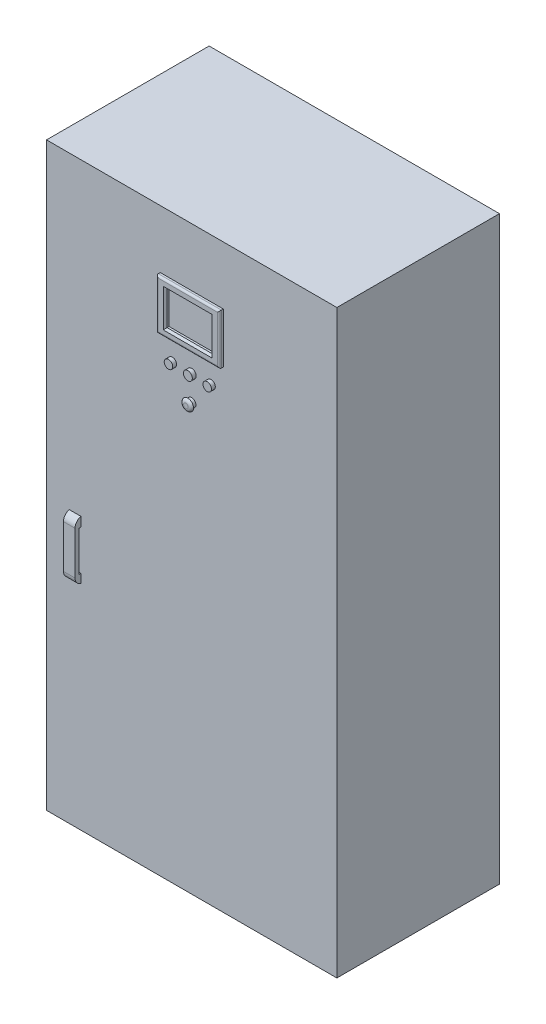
ISO-10303-21;
HEADER;
FILE_DESCRIPTION(('STEP AP214'),'2;1');
FILE_NAME('part.step','',(''),(''),'','','');
FILE_SCHEMA(('AUTOMOTIVE_DESIGN { 1 0 10303 214 1 1 1 1 }'));
ENDSEC;
DATA;
#1=APPLICATION_CONTEXT('core data for automotive mechanical design processes');
#2=APPLICATION_PROTOCOL_DEFINITION('international standard','automotive_design',2000,#1);
#3=PRODUCT_CONTEXT('',#1,'mechanical');
#4=PRODUCT('Part','Part','',(#3));
#5=PRODUCT_RELATED_PRODUCT_CATEGORY('part','',(#4));
#6=PRODUCT_DEFINITION_FORMATION('','',#4);
#7=PRODUCT_DEFINITION_CONTEXT('part definition',#1,'design');
#8=PRODUCT_DEFINITION('design','',#6,#7);
#9=PRODUCT_DEFINITION_SHAPE('','',#8);
#10=(LENGTH_UNIT() NAMED_UNIT(*) SI_UNIT(.MILLI.,.METRE.));
#11=(NAMED_UNIT(*) PLANE_ANGLE_UNIT() SI_UNIT($,.RADIAN.));
#12=(NAMED_UNIT(*) SI_UNIT($,.STERADIAN.) SOLID_ANGLE_UNIT());
#13=UNCERTAINTY_MEASURE_WITH_UNIT(LENGTH_MEASURE(1.E-05),#10,'distance_accuracy_value','');
#14=(GEOMETRIC_REPRESENTATION_CONTEXT(3) GLOBAL_UNCERTAINTY_ASSIGNED_CONTEXT((#13)) GLOBAL_UNIT_ASSIGNED_CONTEXT((#10,
#11,#12)) REPRESENTATION_CONTEXT('',''));
#15=CARTESIAN_POINT('',(0.,0.,0.));
#16=DIRECTION('',(0.,0.,1.));
#17=DIRECTION('',(1.,0.,0.));
#18=AXIS2_PLACEMENT_3D('',#15,#16,#17);
#19=CARTESIAN_POINT('',(0.,1500.,0.));
#20=DIRECTION('',(0.,0.,-1.));
#21=DIRECTION('',(-1.,0.,0.));
#22=AXIS2_PLACEMENT_3D('',#19,#20,#21);
#23=PLANE('',#22);
#24=DIRECTION('',(0.,-1.,0.));
#25=VECTOR('',#24,1.);
#26=CARTESIAN_POINT('',(58.6657650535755,702.214395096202,0.));
#27=LINE('',#26,#25);
#28=CARTESIAN_POINT('',(58.6657650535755,702.214395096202,0.));
#29=VERTEX_POINT('',#28);
#30=CARTESIAN_POINT('',(58.6657650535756,678.940627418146,0.));
#31=VERTEX_POINT('',#30);
#32=EDGE_CURVE('E330',#29,#31,#27,.T.);
#33=ORIENTED_EDGE('',*,*,#32,.F.);
#34=DIRECTION('',(-1.,0.,0.));
#35=VECTOR('',#34,1.);
#36=CARTESIAN_POINT('',(58.6657650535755,702.214395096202,0.));
#37=LINE('',#36,#35);
#38=CARTESIAN_POINT('',(88.6657650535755,702.214395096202,0.));
#39=VERTEX_POINT('',#38);
#40=EDGE_CURVE('E326',#39,#29,#37,.T.);
#41=ORIENTED_EDGE('',*,*,#40,.F.);
#42=DIRECTION('',(0.,1.,0.));
#43=VECTOR('',#42,1.);
#44=CARTESIAN_POINT('',(88.6657650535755,702.214395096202,0.));
#45=LINE('',#44,#43);
#46=CARTESIAN_POINT('',(88.6657650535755,677.99320694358,0.));
#47=VERTEX_POINT('',#46);
#48=EDGE_CURVE('E337',#47,#39,#45,.T.);
#49=ORIENTED_EDGE('',*,*,#48,.F.);
#50=DIRECTION('',(1.,0.,0.));
#51=VECTOR('',#50,1.);
#52=CARTESIAN_POINT('',(78.6657650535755,677.99320694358,0.));
#53=LINE('',#52,#51);
#54=CARTESIAN_POINT('',(78.6657650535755,677.99320694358,0.));
#55=VERTEX_POINT('',#54);
#56=EDGE_CURVE('E57',#55,#47,#53,.T.);
#57=ORIENTED_EDGE('',*,*,#56,.F.);
#58=DIRECTION('',(0.,1.,0.));
#59=VECTOR('',#58,1.);
#60=CARTESIAN_POINT('',(78.6657650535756,574.497572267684,0.));
#61=LINE('',#60,#59);
#62=CARTESIAN_POINT('',(78.6657650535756,574.497572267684,0.));
#63=VERTEX_POINT('',#62);
#64=EDGE_CURVE('E295',#63,#55,#61,.T.);
#65=ORIENTED_EDGE('',*,*,#64,.F.);
#66=DIRECTION('',(1.,0.,0.));
#67=VECTOR('',#66,1.);
#68=CARTESIAN_POINT('',(78.6657650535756,574.497572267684,0.));
#69=LINE('',#68,#67);
#70=CARTESIAN_POINT('',(88.6657650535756,574.497572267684,0.));
#71=VERTEX_POINT('',#70);
#72=EDGE_CURVE('E314',#63,#71,#69,.T.);
#73=ORIENTED_EDGE('',*,*,#72,.T.);
#74=CARTESIAN_POINT('',(88.6657650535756,552.214395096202,0.));
#75=VERTEX_POINT('',#74);
#76=EDGE_CURVE('E338',#75,#71,#45,.T.);
#77=ORIENTED_EDGE('',*,*,#76,.F.);
#78=DIRECTION('',(1.,0.,0.));
#79=VECTOR('',#78,1.);
#80=CARTESIAN_POINT('',(58.6657650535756,552.214395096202,0.));
#81=LINE('',#80,#79);
#82=CARTESIAN_POINT('',(58.6657650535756,552.214395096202,0.));
#83=VERTEX_POINT('',#82);
#84=EDGE_CURVE('E333',#83,#75,#81,.T.);
#85=ORIENTED_EDGE('',*,*,#84,.F.);
#86=CARTESIAN_POINT('',(58.6657650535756,573.902197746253,0.));
#87=VERTEX_POINT('',#86);
#88=EDGE_CURVE('E334',#87,#83,#27,.T.);
#89=ORIENTED_EDGE('',*,*,#88,.F.);
#90=DIRECTION('',(-1.,0.,0.));
#91=VECTOR('',#90,1.);
#92=CARTESIAN_POINT('',(68.6657650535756,573.902197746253,0.));
#93=LINE('',#92,#91);
#94=CARTESIAN_POINT('',(68.6657650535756,573.902197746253,0.));
#95=VERTEX_POINT('',#94);
#96=EDGE_CURVE('E49',#95,#87,#93,.T.);
#97=ORIENTED_EDGE('',*,*,#96,.F.);
#98=DIRECTION('',(0.,-1.,0.));
#99=VECTOR('',#98,1.);
#100=CARTESIAN_POINT('',(68.6657650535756,573.902197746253,0.));
#101=LINE('',#100,#99);
#102=CARTESIAN_POINT('',(68.6657650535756,678.940627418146,0.));
#103=VERTEX_POINT('',#102);
#104=EDGE_CURVE('E268',#103,#95,#101,.T.);
#105=ORIENTED_EDGE('',*,*,#104,.F.);
#106=DIRECTION('',(-1.,0.,0.));
#107=VECTOR('',#106,1.);
#108=CARTESIAN_POINT('',(68.6657650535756,678.940627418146,0.));
#109=LINE('',#108,#107);
#110=EDGE_CURVE('E287',#103,#31,#109,.T.);
#111=ORIENTED_EDGE('',*,*,#110,.T.);
#112=EDGE_LOOP('',(#33,#41,#49,#57,#65,#73,#77,#85,#89,#97,#105,#111));
#113=FACE_BOUND('',#112,.T.);
#114=CARTESIAN_POINT('',(425.,1165.48560768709,0.));
#115=DIRECTION('',(0.,0.,-1.));
#116=DIRECTION('',(-1.,0.,0.));
#117=AXIS2_PLACEMENT_3D('',#114,#115,#116);
#118=CIRCLE('',#117,11.);
#119=CARTESIAN_POINT('',(414.,1165.48560768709,0.));
#120=VERTEX_POINT('',#119);
#121=EDGE_CURVE('E429',#120,#120,#118,.F.);
#122=ORIENTED_EDGE('',*,*,#121,.F.);
#123=EDGE_LOOP('',(#122));
#124=FACE_BOUND('',#123,.T.);
#125=DIRECTION('',(0.,-1.,0.));
#126=VECTOR('',#125,1.);
#127=CARTESIAN_POINT('',(293.5,1350.,0.));
#128=LINE('',#127,#126);
#129=CARTESIAN_POINT('',(293.5,1350.,0.));
#130=VERTEX_POINT('',#129);
#131=CARTESIAN_POINT('',(293.5,1220.,0.));
#132=VERTEX_POINT('',#131);
#133=EDGE_CURVE('E376',#130,#132,#128,.T.);
#134=ORIENTED_EDGE('',*,*,#133,.F.);
#135=DIRECTION('',(-1.,0.,0.));
#136=VECTOR('',#135,1.);
#137=CARTESIAN_POINT('',(293.5,1350.,0.));
#138=LINE('',#137,#136);
#139=CARTESIAN_POINT('',(456.5,1350.,0.));
#140=VERTEX_POINT('',#139);
#141=EDGE_CURVE('E385',#140,#130,#138,.T.);
#142=ORIENTED_EDGE('',*,*,#141,.F.);
#143=DIRECTION('',(0.,1.,0.));
#144=VECTOR('',#143,1.);
#145=CARTESIAN_POINT('',(456.5,1350.,0.));
#146=LINE('',#145,#144);
#147=CARTESIAN_POINT('',(456.5,1220.,0.));
#148=VERTEX_POINT('',#147);
#149=EDGE_CURVE('E382',#148,#140,#146,.T.);
#150=ORIENTED_EDGE('',*,*,#149,.F.);
#151=DIRECTION('',(1.,0.,0.));
#152=VECTOR('',#151,1.);
#153=CARTESIAN_POINT('',(293.5,1220.,0.));
#154=LINE('',#153,#152);
#155=EDGE_CURVE('E379',#132,#148,#154,.T.);
#156=ORIENTED_EDGE('',*,*,#155,.F.);
#157=EDGE_LOOP('',(#134,#142,#150,#156));
#158=FACE_BOUND('',#157,.T.);
#159=DIRECTION('',(1.,0.,0.));
#160=VECTOR('',#159,1.);
#161=CARTESIAN_POINT('',(0.,0.,0.));
#162=LINE('',#161,#160);
#163=CARTESIAN_POINT('',(0.,0.,0.));
#164=VERTEX_POINT('',#163);
#165=CARTESIAN_POINT('',(750.,0.,0.));
#166=VERTEX_POINT('',#165);
#167=EDGE_CURVE('E410',#164,#166,#162,.T.);
#168=ORIENTED_EDGE('',*,*,#167,.T.);
#169=DIRECTION('',(0.,-1.,0.));
#170=VECTOR('',#169,1.);
#171=CARTESIAN_POINT('',(750.,1500.,0.));
#172=LINE('',#171,#170);
#173=CARTESIAN_POINT('',(750.,1500.,0.));
#174=VERTEX_POINT('',#173);
#175=EDGE_CURVE('E420',#174,#166,#172,.T.);
#176=ORIENTED_EDGE('',*,*,#175,.F.);
#177=DIRECTION('',(1.,0.,0.));
#178=VECTOR('',#177,1.);
#179=CARTESIAN_POINT('',(0.,1500.,0.));
#180=LINE('',#179,#178);
#181=CARTESIAN_POINT('',(0.,1500.,0.));
#182=VERTEX_POINT('',#181);
#183=EDGE_CURVE('E400',#182,#174,#180,.T.);
#184=ORIENTED_EDGE('',*,*,#183,.F.);
#185=DIRECTION('',(0.,-1.,0.));
#186=VECTOR('',#185,1.);
#187=CARTESIAN_POINT('',(0.,1500.,0.));
#188=LINE('',#187,#186);
#189=EDGE_CURVE('E423',#182,#164,#188,.T.);
#190=ORIENTED_EDGE('',*,*,#189,.T.);
#191=EDGE_LOOP('',(#168,#176,#184,#190));
#192=FACE_BOUND('',#191,.T.);
#193=CARTESIAN_POINT('',(325.,1165.48560768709,0.));
#194=DIRECTION('',(0.,0.,-1.));
#195=DIRECTION('',(-1.,0.,0.));
#196=AXIS2_PLACEMENT_3D('',#193,#194,#195);
#197=CIRCLE('',#196,11.);
#198=CARTESIAN_POINT('',(314.,1165.48560768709,0.));
#199=VERTEX_POINT('',#198);
#200=EDGE_CURVE('E426',#199,#199,#197,.F.);
#201=ORIENTED_EDGE('',*,*,#200,.F.);
#202=EDGE_LOOP('',(#201));
#203=FACE_BOUND('',#202,.T.);
#204=CARTESIAN_POINT('',(375.,1100.,0.));
#205=DIRECTION('',(0.,0.,-1.));
#206=DIRECTION('',(-1.,0.,0.));
#207=AXIS2_PLACEMENT_3D('',#204,#205,#206);
#208=CIRCLE('',#207,11.);
#209=CARTESIAN_POINT('',(364.,1100.,0.));
#210=VERTEX_POINT('',#209);
#211=EDGE_CURVE('E432',#210,#210,#208,.F.);
#212=ORIENTED_EDGE('',*,*,#211,.F.);
#213=EDGE_LOOP('',(#212));
#214=FACE_BOUND('',#213,.T.);
#215=CARTESIAN_POINT('',(375.,1164.89981854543,0.));
#216=DIRECTION('',(0.,0.,-1.));
#217=DIRECTION('',(-1.,0.,0.));
#218=AXIS2_PLACEMENT_3D('',#215,#216,#217);
#219=CIRCLE('',#218,11.4999999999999);
#220=CARTESIAN_POINT('',(363.5,1164.89981854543,0.));
#221=VERTEX_POINT('',#220);
#222=EDGE_CURVE('E11',#221,#221,#219,.F.);
#223=ORIENTED_EDGE('',*,*,#222,.F.);
#224=EDGE_LOOP('',(#223));
#225=FACE_BOUND('',#224,.T.);
#226=ADVANCED_FACE('F34',(#113,#124,#158,#192,#203,#214,#225),#23,.F.);
#227=CARTESIAN_POINT('',(0.,1500.,0.));
#228=DIRECTION('',(1.,0.,0.));
#229=DIRECTION('',(0.,0.,-1.));
#230=AXIS2_PLACEMENT_3D('',#227,#228,#229);
#231=PLANE('',#230);
#232=DIRECTION('',(0.,0.,1.));
#233=VECTOR('',#232,1.);
#234=CARTESIAN_POINT('',(0.,0.,0.));
#235=LINE('',#234,#233);
#236=CARTESIAN_POINT('',(0.,0.,-420.));
#237=VERTEX_POINT('',#236);
#238=EDGE_CURVE('E396',#237,#164,#235,.T.);
#239=ORIENTED_EDGE('',*,*,#238,.T.);
#240=ORIENTED_EDGE('',*,*,#189,.F.);
#241=DIRECTION('',(0.,0.,1.));
#242=VECTOR('',#241,1.);
#243=CARTESIAN_POINT('',(0.,1500.,0.));
#244=LINE('',#243,#242);
#245=CARTESIAN_POINT('',(0.,1500.,-420.));
#246=VERTEX_POINT('',#245);
#247=EDGE_CURVE('E397',#246,#182,#244,.T.);
#248=ORIENTED_EDGE('',*,*,#247,.F.);
#249=DIRECTION('',(0.,-1.,0.));
#250=VECTOR('',#249,1.);
#251=CARTESIAN_POINT('',(0.,1500.,-420.));
#252=LINE('',#251,#250);
#253=EDGE_CURVE('E407',#246,#237,#252,.T.);
#254=ORIENTED_EDGE('',*,*,#253,.T.);
#255=EDGE_LOOP('',(#239,#240,#248,#254));
#256=FACE_BOUND('',#255,.T.);
#257=ADVANCED_FACE('F545',(#256),#231,.F.);
#258=CARTESIAN_POINT('',(750.,1500.,0.));
#259=DIRECTION('',(-1.,0.,0.));
#260=DIRECTION('',(0.,0.,1.));
#261=AXIS2_PLACEMENT_3D('',#258,#259,#260);
#262=PLANE('',#261);
#263=DIRECTION('',(0.,0.,-1.));
#264=VECTOR('',#263,1.);
#265=CARTESIAN_POINT('',(750.,0.,0.));
#266=LINE('',#265,#264);
#267=CARTESIAN_POINT('',(750.,0.,-420.));
#268=VERTEX_POINT('',#267);
#269=EDGE_CURVE('E412',#166,#268,#266,.T.);
#270=ORIENTED_EDGE('',*,*,#269,.T.);
#271=DIRECTION('',(0.,-1.,0.));
#272=VECTOR('',#271,1.);
#273=CARTESIAN_POINT('',(750.,1500.,-420.));
#274=LINE('',#273,#272);
#275=CARTESIAN_POINT('',(750.,1500.,-420.));
#276=VERTEX_POINT('',#275);
#277=EDGE_CURVE('E417',#276,#268,#274,.T.);
#278=ORIENTED_EDGE('',*,*,#277,.F.);
#279=DIRECTION('',(0.,0.,-1.));
#280=VECTOR('',#279,1.);
#281=CARTESIAN_POINT('',(750.,1500.,0.));
#282=LINE('',#281,#280);
#283=EDGE_CURVE('E403',#174,#276,#282,.T.);
#284=ORIENTED_EDGE('',*,*,#283,.F.);
#285=ORIENTED_EDGE('',*,*,#175,.T.);
#286=EDGE_LOOP('',(#270,#278,#284,#285));
#287=FACE_BOUND('',#286,.T.);
#288=ADVANCED_FACE('F551',(#287),#262,.F.);
#289=CARTESIAN_POINT('',(0.,1500.,-420.));
#290=DIRECTION('',(0.,0.,1.));
#291=DIRECTION('',(1.,0.,0.));
#292=AXIS2_PLACEMENT_3D('',#289,#290,#291);
#293=PLANE('',#292);
#294=DIRECTION('',(-1.,0.,0.));
#295=VECTOR('',#294,1.);
#296=CARTESIAN_POINT('',(0.,0.,-420.));
#297=LINE('',#296,#295);
#298=EDGE_CURVE('E401',#268,#237,#297,.T.);
#299=ORIENTED_EDGE('',*,*,#298,.T.);
#300=ORIENTED_EDGE('',*,*,#253,.F.);
#301=DIRECTION('',(-1.,0.,0.));
#302=VECTOR('',#301,1.);
#303=CARTESIAN_POINT('',(0.,1500.,-420.));
#304=LINE('',#303,#302);
#305=EDGE_CURVE('E405',#276,#246,#304,.T.);
#306=ORIENTED_EDGE('',*,*,#305,.F.);
#307=ORIENTED_EDGE('',*,*,#277,.T.);
#308=EDGE_LOOP('',(#299,#300,#306,#307));
#309=FACE_BOUND('',#308,.T.);
#310=ADVANCED_FACE('F659',(#309),#293,.F.);
#311=CARTESIAN_POINT('',(0.,1500.,-420.));
#312=DIRECTION('',(0.,-1.,0.));
#313=DIRECTION('',(0.,0.,-1.));
#314=AXIS2_PLACEMENT_3D('',#311,#312,#313);
#315=PLANE('',#314);
#316=ORIENTED_EDGE('',*,*,#247,.T.);
#317=ORIENTED_EDGE('',*,*,#183,.T.);
#318=ORIENTED_EDGE('',*,*,#283,.T.);
#319=ORIENTED_EDGE('',*,*,#305,.T.);
#320=EDGE_LOOP('',(#316,#317,#318,#319));
#321=FACE_BOUND('',#320,.T.);
#322=ADVANCED_FACE('F656',(#321),#315,.F.);
#323=CARTESIAN_POINT('',(0.,0.,-420.));
#324=DIRECTION('',(0.,-1.,0.));
#325=DIRECTION('',(0.,0.,-1.));
#326=AXIS2_PLACEMENT_3D('',#323,#324,#325);
#327=PLANE('',#326);
#328=CARTESIAN_POINT('',(125.809545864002,0.,-389.004645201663));
#329=DIRECTION('',(0.,-1.,0.));
#330=DIRECTION('',(0.,0.,-1.));
#331=AXIS2_PLACEMENT_3D('',#328,#329,#330);
#332=CIRCLE('',#331,5.49999999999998);
#333=CARTESIAN_POINT('',(125.809545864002,0.,-394.504645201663));
#334=VERTEX_POINT('',#333);
#335=EDGE_CURVE('E242',#334,#334,#332,.T.);
#336=ORIENTED_EDGE('',*,*,#335,.F.);
#337=EDGE_LOOP('',(#336));
#338=FACE_BOUND('',#337,.T.);
#339=CARTESIAN_POINT('',(125.92891230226,0.,-45.4694269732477));
#340=DIRECTION('',(0.,-1.,0.));
#341=DIRECTION('',(0.,0.,-1.));
#342=AXIS2_PLACEMENT_3D('',#339,#340,#341);
#343=CIRCLE('',#342,5.49999999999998);
#344=CARTESIAN_POINT('',(125.92891230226,0.,-50.9694269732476));
#345=VERTEX_POINT('',#344);
#346=EDGE_CURVE('E241',#345,#345,#343,.T.);
#347=ORIENTED_EDGE('',*,*,#346,.F.);
#348=EDGE_LOOP('',(#347));
#349=FACE_BOUND('',#348,.T.);
#350=CARTESIAN_POINT('',(622.564613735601,0.,-44.0988043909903));
#351=DIRECTION('',(0.,-1.,0.));
#352=DIRECTION('',(0.,0.,-1.));
#353=AXIS2_PLACEMENT_3D('',#350,#351,#352);
#354=CIRCLE('',#353,5.49999999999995);
#355=CARTESIAN_POINT('',(622.564613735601,0.,-49.5988043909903));
#356=VERTEX_POINT('',#355);
#357=EDGE_CURVE('E252',#356,#356,#354,.T.);
#358=ORIENTED_EDGE('',*,*,#357,.F.);
#359=EDGE_LOOP('',(#358));
#360=FACE_BOUND('',#359,.T.);
#361=CARTESIAN_POINT('',(622.036868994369,0.,-389.496763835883));
#362=DIRECTION('',(0.,-1.,0.));
#363=DIRECTION('',(0.,0.,-1.));
#364=AXIS2_PLACEMENT_3D('',#361,#362,#363);
#365=CIRCLE('',#364,5.49999999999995);
#366=CARTESIAN_POINT('',(622.036868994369,0.,-394.996763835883));
#367=VERTEX_POINT('',#366);
#368=EDGE_CURVE('E258',#367,#367,#365,.T.);
#369=ORIENTED_EDGE('',*,*,#368,.F.);
#370=EDGE_LOOP('',(#369));
#371=FACE_BOUND('',#370,.T.);
#372=ORIENTED_EDGE('',*,*,#238,.F.);
#373=ORIENTED_EDGE('',*,*,#298,.F.);
#374=ORIENTED_EDGE('',*,*,#269,.F.);
#375=ORIENTED_EDGE('',*,*,#167,.F.);
#376=EDGE_LOOP('',(#372,#373,#374,#375));
#377=FACE_BOUND('',#376,.T.);
#378=ADVANCED_FACE('F607',(#338,#349,#360,#371,#377),#327,.T.);
#379=CARTESIAN_POINT('',(293.5,1220.,10.));
#380=DIRECTION('',(0.,0.,1.));
#381=DIRECTION('',(1.,0.,0.));
#382=AXIS2_PLACEMENT_3D('',#379,#380,#381);
#383=PLANE('',#382);
#384=DIRECTION('',(1.,0.,0.));
#385=VECTOR('',#384,1.);
#386=CARTESIAN_POINT('',(293.5,1333.28524782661,10.));
#387=LINE('',#386,#385);
#388=CARTESIAN_POINT('',(311.5,1333.28524782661,10.));
#389=VERTEX_POINT('',#388);
#390=CARTESIAN_POINT('',(437.022533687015,1333.28524782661,10.));
#391=VERTEX_POINT('',#390);
#392=EDGE_CURVE('E469',#389,#391,#387,.T.);
#393=ORIENTED_EDGE('',*,*,#392,.T.);
#394=DIRECTION('',(0.,-1.,0.));
#395=VECTOR('',#394,1.);
#396=CARTESIAN_POINT('',(437.022533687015,1220.,10.));
#397=LINE('',#396,#395);
#398=CARTESIAN_POINT('',(437.022533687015,1235.65223914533,10.));
#399=VERTEX_POINT('',#398);
#400=EDGE_CURVE('E473',#391,#399,#397,.T.);
#401=ORIENTED_EDGE('',*,*,#400,.T.);
#402=DIRECTION('',(-1.,0.,0.));
#403=VECTOR('',#402,1.);
#404=CARTESIAN_POINT('',(293.5,1235.65223914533,10.));
#405=LINE('',#404,#403);
#406=CARTESIAN_POINT('',(311.5,1235.65223914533,10.));
#407=VERTEX_POINT('',#406);
#408=EDGE_CURVE('E471',#399,#407,#405,.T.);
#409=ORIENTED_EDGE('',*,*,#408,.T.);
#410=DIRECTION('',(0.,1.,0.));
#411=VECTOR('',#410,1.);
#412=CARTESIAN_POINT('',(311.5,1220.,10.));
#413=LINE('',#412,#411);
#414=EDGE_CURVE('E467',#407,#389,#413,.T.);
#415=ORIENTED_EDGE('',*,*,#414,.T.);
#416=EDGE_LOOP('',(#393,#401,#409,#415));
#417=FACE_BOUND('',#416,.T.);
#418=DIRECTION('',(1.,0.,0.));
#419=VECTOR('',#418,1.);
#420=CARTESIAN_POINT('',(456.5,1225.,10.));
#421=LINE('',#420,#419);
#422=CARTESIAN_POINT('',(298.5,1225.,10.));
#423=VERTEX_POINT('',#422);
#424=CARTESIAN_POINT('',(451.5,1225.,10.));
#425=VERTEX_POINT('',#424);
#426=EDGE_CURVE('E442',#423,#425,#421,.T.);
#427=ORIENTED_EDGE('',*,*,#426,.T.);
#428=DIRECTION('',(0.,1.,0.));
#429=VECTOR('',#428,1.);
#430=CARTESIAN_POINT('',(451.5,1350.,10.));
#431=LINE('',#430,#429);
#432=CARTESIAN_POINT('',(451.5,1345.,10.));
#433=VERTEX_POINT('',#432);
#434=EDGE_CURVE('E444',#425,#433,#431,.T.);
#435=ORIENTED_EDGE('',*,*,#434,.T.);
#436=DIRECTION('',(-1.,0.,0.));
#437=VECTOR('',#436,1.);
#438=CARTESIAN_POINT('',(293.5,1345.,10.));
#439=LINE('',#438,#437);
#440=CARTESIAN_POINT('',(298.5,1345.,10.));
#441=VERTEX_POINT('',#440);
#442=EDGE_CURVE('E438',#433,#441,#439,.T.);
#443=ORIENTED_EDGE('',*,*,#442,.T.);
#444=DIRECTION('',(0.,-1.,0.));
#445=VECTOR('',#444,1.);
#446=CARTESIAN_POINT('',(298.5,1220.,10.));
#447=LINE('',#446,#445);
#448=EDGE_CURVE('E440',#441,#423,#447,.T.);
#449=ORIENTED_EDGE('',*,*,#448,.T.);
#450=EDGE_LOOP('',(#427,#435,#443,#449));
#451=FACE_BOUND('',#450,.T.);
#452=ADVANCED_FACE('F603',(#417,#451),#383,.T.);
#453=CARTESIAN_POINT('',(293.5,1350.,10.));
#454=DIRECTION('',(1.,0.,0.));
#455=DIRECTION('',(0.,0.,-1.));
#456=AXIS2_PLACEMENT_3D('',#453,#454,#455);
#457=PLANE('',#456);
#458=DIRECTION('',(0.,0.,-1.));
#459=VECTOR('',#458,1.);
#460=CARTESIAN_POINT('',(293.5,1220.,10.));
#461=LINE('',#460,#459);
#462=CARTESIAN_POINT('',(293.5,1220.,5.));
#463=VERTEX_POINT('',#462);
#464=EDGE_CURVE('E394',#463,#132,#461,.T.);
#465=ORIENTED_EDGE('',*,*,#464,.F.);
#466=DIRECTION('',(0.,-1.,0.));
#467=VECTOR('',#466,1.);
#468=CARTESIAN_POINT('',(293.5,1350.,5.));
#469=LINE('',#468,#467);
#470=CARTESIAN_POINT('',(293.5,1350.,5.));
#471=VERTEX_POINT('',#470);
#472=EDGE_CURVE('E452',#463,#471,#469,.F.);
#473=ORIENTED_EDGE('',*,*,#472,.T.);
#474=DIRECTION('',(0.,0.,-1.));
#475=VECTOR('',#474,1.);
#476=CARTESIAN_POINT('',(293.5,1350.,10.));
#477=LINE('',#476,#475);
#478=EDGE_CURVE('E388',#471,#130,#477,.T.);
#479=ORIENTED_EDGE('',*,*,#478,.T.);
#480=ORIENTED_EDGE('',*,*,#133,.T.);
#481=EDGE_LOOP('',(#465,#473,#479,#480));
#482=FACE_BOUND('',#481,.T.);
#483=ADVANCED_FACE('F606',(#482),#457,.F.);
#484=CARTESIAN_POINT('',(293.5,1220.,10.));
#485=DIRECTION('',(0.,1.,0.));
#486=DIRECTION('',(0.,0.,1.));
#487=AXIS2_PLACEMENT_3D('',#484,#485,#486);
#488=PLANE('',#487);
#489=DIRECTION('',(0.,0.,-1.));
#490=VECTOR('',#489,1.);
#491=CARTESIAN_POINT('',(456.5,1220.,10.));
#492=LINE('',#491,#490);
#493=CARTESIAN_POINT('',(456.5,1220.,5.));
#494=VERTEX_POINT('',#493);
#495=EDGE_CURVE('E392',#494,#148,#492,.T.);
#496=ORIENTED_EDGE('',*,*,#495,.F.);
#497=DIRECTION('',(1.,0.,0.));
#498=VECTOR('',#497,1.);
#499=CARTESIAN_POINT('',(293.5,1220.,5.));
#500=LINE('',#499,#498);
#501=EDGE_CURVE('E450',#494,#463,#500,.F.);
#502=ORIENTED_EDGE('',*,*,#501,.T.);
#503=ORIENTED_EDGE('',*,*,#464,.T.);
#504=ORIENTED_EDGE('',*,*,#155,.T.);
#505=EDGE_LOOP('',(#496,#502,#503,#504));
#506=FACE_BOUND('',#505,.T.);
#507=ADVANCED_FACE('F645',(#506),#488,.F.);
#508=CARTESIAN_POINT('',(456.5,1350.,10.));
#509=DIRECTION('',(-1.,0.,0.));
#510=DIRECTION('',(0.,0.,1.));
#511=AXIS2_PLACEMENT_3D('',#508,#509,#510);
#512=PLANE('',#511);
#513=DIRECTION('',(0.,0.,-1.));
#514=VECTOR('',#513,1.);
#515=CARTESIAN_POINT('',(456.5,1350.,10.));
#516=LINE('',#515,#514);
#517=CARTESIAN_POINT('',(456.5,1350.,5.));
#518=VERTEX_POINT('',#517);
#519=EDGE_CURVE('E390',#518,#140,#516,.T.);
#520=ORIENTED_EDGE('',*,*,#519,.F.);
#521=DIRECTION('',(0.,1.,0.));
#522=VECTOR('',#521,1.);
#523=CARTESIAN_POINT('',(456.5,1220.,5.));
#524=LINE('',#523,#522);
#525=EDGE_CURVE('E447',#518,#494,#524,.F.);
#526=ORIENTED_EDGE('',*,*,#525,.T.);
#527=ORIENTED_EDGE('',*,*,#495,.T.);
#528=ORIENTED_EDGE('',*,*,#149,.T.);
#529=EDGE_LOOP('',(#520,#526,#527,#528));
#530=FACE_BOUND('',#529,.T.);
#531=ADVANCED_FACE('F642',(#530),#512,.F.);
#532=CARTESIAN_POINT('',(293.5,1350.,10.));
#533=DIRECTION('',(0.,-1.,0.));
#534=DIRECTION('',(0.,0.,-1.));
#535=AXIS2_PLACEMENT_3D('',#532,#533,#534);
#536=PLANE('',#535);
#537=ORIENTED_EDGE('',*,*,#478,.F.);
#538=DIRECTION('',(-1.,0.,0.));
#539=VECTOR('',#538,1.);
#540=CARTESIAN_POINT('',(456.5,1350.,5.));
#541=LINE('',#540,#539);
#542=EDGE_CURVE('E454',#471,#518,#541,.F.);
#543=ORIENTED_EDGE('',*,*,#542,.T.);
#544=ORIENTED_EDGE('',*,*,#519,.T.);
#545=ORIENTED_EDGE('',*,*,#141,.T.);
#546=EDGE_LOOP('',(#537,#543,#544,#545));
#547=FACE_BOUND('',#546,.T.);
#548=ADVANCED_FACE('F634',(#547),#536,.F.);
#549=CARTESIAN_POINT('',(316.5,1240.65223914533,10.));
#550=DIRECTION('',(1.,0.,0.));
#551=DIRECTION('',(0.,0.,-1.));
#552=AXIS2_PLACEMENT_3D('',#549,#550,#551);
#553=PLANE('',#552);
#554=DIRECTION('',(0.,0.,-1.));
#555=VECTOR('',#554,1.);
#556=CARTESIAN_POINT('',(316.5,1328.28524782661,10.));
#557=LINE('',#556,#555);
#558=CARTESIAN_POINT('',(316.5,1328.28524782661,5.00000000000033));
#559=VERTEX_POINT('',#558);
#560=CARTESIAN_POINT('',(316.5,1328.28524782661,0.));
#561=VERTEX_POINT('',#560);
#562=EDGE_CURVE('E368',#559,#561,#557,.T.);
#563=ORIENTED_EDGE('',*,*,#562,.F.);
#564=DIRECTION('',(0.,-1.,0.));
#565=VECTOR('',#564,1.);
#566=CARTESIAN_POINT('',(316.5,1240.65223914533,5.00000000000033));
#567=LINE('',#566,#565);
#568=CARTESIAN_POINT('',(316.5,1240.65223914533,5.00000000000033));
#569=VERTEX_POINT('',#568);
#570=EDGE_CURVE('E480',#559,#569,#567,.T.);
#571=ORIENTED_EDGE('',*,*,#570,.T.);
#572=DIRECTION('',(0.,0.,-1.));
#573=VECTOR('',#572,1.);
#574=CARTESIAN_POINT('',(316.5,1240.65223914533,10.));
#575=LINE('',#574,#573);
#576=CARTESIAN_POINT('',(316.5,1240.65223914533,0.));
#577=VERTEX_POINT('',#576);
#578=EDGE_CURVE('E374',#569,#577,#575,.T.);
#579=ORIENTED_EDGE('',*,*,#578,.T.);
#580=DIRECTION('',(0.,-1.,0.));
#581=VECTOR('',#580,1.);
#582=CARTESIAN_POINT('',(316.5,1240.65223914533,0.));
#583=LINE('',#582,#581);
#584=EDGE_CURVE('E356',#561,#577,#583,.T.);
#585=ORIENTED_EDGE('',*,*,#584,.F.);
#586=EDGE_LOOP('',(#563,#571,#579,#585));
#587=FACE_BOUND('',#586,.T.);
#588=ADVANCED_FACE('F577',(#587),#553,.T.);
#589=CARTESIAN_POINT('',(316.5,1240.65223914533,10.));
#590=DIRECTION('',(0.,1.,0.));
#591=DIRECTION('',(0.,0.,1.));
#592=AXIS2_PLACEMENT_3D('',#589,#590,#591);
#593=PLANE('',#592);
#594=ORIENTED_EDGE('',*,*,#578,.F.);
#595=DIRECTION('',(1.,0.,0.));
#596=VECTOR('',#595,1.);
#597=CARTESIAN_POINT('',(316.5,1240.65223914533,5.00000000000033));
#598=LINE('',#597,#596);
#599=CARTESIAN_POINT('',(432.022533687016,1240.65223914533,5.00000000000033));
#600=VERTEX_POINT('',#599);
#601=EDGE_CURVE('E476',#569,#600,#598,.T.);
#602=ORIENTED_EDGE('',*,*,#601,.T.);
#603=DIRECTION('',(0.,0.,-1.));
#604=VECTOR('',#603,1.);
#605=CARTESIAN_POINT('',(432.022533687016,1240.65223914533,10.));
#606=LINE('',#605,#604);
#607=CARTESIAN_POINT('',(432.022533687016,1240.65223914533,0.));
#608=VERTEX_POINT('',#607);
#609=EDGE_CURVE('E372',#600,#608,#606,.T.);
#610=ORIENTED_EDGE('',*,*,#609,.T.);
#611=DIRECTION('',(1.,0.,0.));
#612=VECTOR('',#611,1.);
#613=CARTESIAN_POINT('',(316.5,1240.65223914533,0.));
#614=LINE('',#613,#612);
#615=EDGE_CURVE('E359',#577,#608,#614,.T.);
#616=ORIENTED_EDGE('',*,*,#615,.F.);
#617=EDGE_LOOP('',(#594,#602,#610,#616));
#618=FACE_BOUND('',#617,.T.);
#619=ADVANCED_FACE('F582',(#618),#593,.T.);
#620=CARTESIAN_POINT('',(432.022533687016,1240.65223914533,10.));
#621=DIRECTION('',(-1.,0.,0.));
#622=DIRECTION('',(0.,0.,1.));
#623=AXIS2_PLACEMENT_3D('',#620,#621,#622);
#624=PLANE('',#623);
#625=ORIENTED_EDGE('',*,*,#609,.F.);
#626=DIRECTION('',(0.,1.,0.));
#627=VECTOR('',#626,1.);
#628=CARTESIAN_POINT('',(432.022533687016,1240.65223914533,5.00000000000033));
#629=LINE('',#628,#627);
#630=CARTESIAN_POINT('',(432.022533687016,1328.28524782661,5.00000000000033));
#631=VERTEX_POINT('',#630);
#632=EDGE_CURVE('E456',#600,#631,#629,.T.);
#633=ORIENTED_EDGE('',*,*,#632,.T.);
#634=DIRECTION('',(0.,0.,-1.));
#635=VECTOR('',#634,1.);
#636=CARTESIAN_POINT('',(432.022533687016,1328.28524782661,10.));
#637=LINE('',#636,#635);
#638=CARTESIAN_POINT('',(432.022533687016,1328.28524782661,0.));
#639=VERTEX_POINT('',#638);
#640=EDGE_CURVE('E370',#631,#639,#637,.T.);
#641=ORIENTED_EDGE('',*,*,#640,.T.);
#642=DIRECTION('',(0.,1.,0.));
#643=VECTOR('',#642,1.);
#644=CARTESIAN_POINT('',(432.022533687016,1240.65223914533,0.));
#645=LINE('',#644,#643);
#646=EDGE_CURVE('E362',#608,#639,#645,.T.);
#647=ORIENTED_EDGE('',*,*,#646,.F.);
#648=EDGE_LOOP('',(#625,#633,#641,#647));
#649=FACE_BOUND('',#648,.T.);
#650=ADVANCED_FACE('F566',(#649),#624,.T.);
#651=CARTESIAN_POINT('',(316.5,1328.28524782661,10.));
#652=DIRECTION('',(0.,-1.,0.));
#653=DIRECTION('',(0.,0.,-1.));
#654=AXIS2_PLACEMENT_3D('',#651,#652,#653);
#655=PLANE('',#654);
#656=ORIENTED_EDGE('',*,*,#640,.F.);
#657=DIRECTION('',(-1.,0.,0.));
#658=VECTOR('',#657,1.);
#659=CARTESIAN_POINT('',(316.5,1328.28524782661,5.00000000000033));
#660=LINE('',#659,#658);
#661=EDGE_CURVE('E478',#631,#559,#660,.T.);
#662=ORIENTED_EDGE('',*,*,#661,.T.);
#663=ORIENTED_EDGE('',*,*,#562,.T.);
#664=DIRECTION('',(-1.,0.,0.));
#665=VECTOR('',#664,1.);
#666=CARTESIAN_POINT('',(316.5,1328.28524782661,0.));
#667=LINE('',#666,#665);
#668=EDGE_CURVE('E365',#639,#561,#667,.T.);
#669=ORIENTED_EDGE('',*,*,#668,.F.);
#670=EDGE_LOOP('',(#656,#662,#663,#669));
#671=FACE_BOUND('',#670,.T.);
#672=ADVANCED_FACE('F557',(#671),#655,.T.);
#673=ORIENTED_EDGE('',*,*,#668,.T.);
#674=ORIENTED_EDGE('',*,*,#584,.T.);
#675=ORIENTED_EDGE('',*,*,#615,.T.);
#676=ORIENTED_EDGE('',*,*,#646,.T.);
#677=EDGE_LOOP('',(#673,#674,#675,#676));
#678=FACE_BOUND('',#677,.T.);
#679=ADVANCED_FACE('F547',(#678),#23,.F.);
#680=CARTESIAN_POINT('',(325.,1165.48560768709,10.));
#681=DIRECTION('',(0.,0.,-1.));
#682=DIRECTION('',(-1.,0.,0.));
#683=AXIS2_PLACEMENT_3D('',#680,#681,#682);
#684=CYLINDRICAL_SURFACE('',#683,11.);
#685=CARTESIAN_POINT('',(325.,1165.48560768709,10.));
#686=DIRECTION('',(0.,0.,1.));
#687=DIRECTION('',(1.,0.,0.));
#688=AXIS2_PLACEMENT_3D('',#685,#686,#687);
#689=CIRCLE('',#688,11.);
#690=CARTESIAN_POINT('',(336.,1165.48560768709,10.));
#691=VERTEX_POINT('',#690);
#692=EDGE_CURVE('E353',#691,#691,#689,.T.);
#693=ORIENTED_EDGE('',*,*,#692,.F.);
#694=EDGE_LOOP('',(#693));
#695=FACE_BOUND('',#694,.T.);
#696=ORIENTED_EDGE('',*,*,#200,.T.);
#697=EDGE_LOOP('',(#696));
#698=FACE_BOUND('',#697,.T.);
#699=ADVANCED_FACE('F556',(#695,#698),#684,.T.);
#700=CARTESIAN_POINT('',(325.,1165.48560768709,10.));
#701=DIRECTION('',(0.,0.,1.));
#702=DIRECTION('',(1.,0.,0.));
#703=AXIS2_PLACEMENT_3D('',#700,#701,#702);
#704=PLANE('',#703);
#705=ORIENTED_EDGE('',*,*,#692,.T.);
#706=EDGE_LOOP('',(#705));
#707=FACE_BOUND('',#706,.T.);
#708=ADVANCED_FACE('F563',(#707),#704,.T.);
#709=CARTESIAN_POINT('',(425.,1165.48560768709,10.));
#710=DIRECTION('',(0.,0.,-1.));
#711=DIRECTION('',(-1.,0.,0.));
#712=AXIS2_PLACEMENT_3D('',#709,#710,#711);
#713=CYLINDRICAL_SURFACE('',#712,11.);
#714=CARTESIAN_POINT('',(425.,1165.48560768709,10.));
#715=DIRECTION('',(0.,0.,1.));
#716=DIRECTION('',(1.,0.,0.));
#717=AXIS2_PLACEMENT_3D('',#714,#715,#716);
#718=CIRCLE('',#717,11.);
#719=CARTESIAN_POINT('',(436.,1165.48560768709,10.));
#720=VERTEX_POINT('',#719);
#721=EDGE_CURVE('E350',#720,#720,#718,.T.);
#722=ORIENTED_EDGE('',*,*,#721,.F.);
#723=EDGE_LOOP('',(#722));
#724=FACE_BOUND('',#723,.T.);
#725=ORIENTED_EDGE('',*,*,#121,.T.);
#726=EDGE_LOOP('',(#725));
#727=FACE_BOUND('',#726,.T.);
#728=ADVANCED_FACE('F777',(#724,#727),#713,.T.);
#729=CARTESIAN_POINT('',(425.,1165.48560768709,10.));
#730=DIRECTION('',(0.,0.,1.));
#731=DIRECTION('',(1.,0.,0.));
#732=AXIS2_PLACEMENT_3D('',#729,#730,#731);
#733=PLANE('',#732);
#734=ORIENTED_EDGE('',*,*,#721,.T.);
#735=EDGE_LOOP('',(#734));
#736=FACE_BOUND('',#735,.T.);
#737=ADVANCED_FACE('F772',(#736),#733,.T.);
#738=CARTESIAN_POINT('',(375.,1100.,10.));
#739=DIRECTION('',(0.,0.,-1.));
#740=DIRECTION('',(-1.,0.,0.));
#741=AXIS2_PLACEMENT_3D('',#738,#739,#740);
#742=CYLINDRICAL_SURFACE('',#741,11.);
#743=CARTESIAN_POINT('',(375.,1100.,10.));
#744=DIRECTION('',(0.,0.,1.));
#745=DIRECTION('',(1.,0.,0.));
#746=AXIS2_PLACEMENT_3D('',#743,#744,#745);
#747=CIRCLE('',#746,11.);
#748=CARTESIAN_POINT('',(386.,1100.,10.));
#749=VERTEX_POINT('',#748);
#750=EDGE_CURVE('E346',#749,#749,#747,.T.);
#751=ORIENTED_EDGE('',*,*,#750,.F.);
#752=EDGE_LOOP('',(#751));
#753=FACE_BOUND('',#752,.T.);
#754=ORIENTED_EDGE('',*,*,#211,.T.);
#755=EDGE_LOOP('',(#754));
#756=FACE_BOUND('',#755,.T.);
#757=ADVANCED_FACE('F766',(#753,#756),#742,.T.);
#758=CARTESIAN_POINT('',(375.,1100.,10.));
#759=DIRECTION('',(0.,0.,1.));
#760=DIRECTION('',(1.,0.,0.));
#761=AXIS2_PLACEMENT_3D('',#758,#759,#760);
#762=PLANE('',#761);
#763=CARTESIAN_POINT('',(375.,1100.,10.));
#764=DIRECTION('',(0.,0.,1.));
#765=DIRECTION('',(1.,0.,0.));
#766=AXIS2_PLACEMENT_3D('',#763,#764,#765);
#767=CIRCLE('',#766,14.7066830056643);
#768=CARTESIAN_POINT('',(389.706683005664,1100.,10.));
#769=VERTEX_POINT('',#768);
#770=EDGE_CURVE('E343',#769,#769,#767,.T.);
#771=ORIENTED_EDGE('',*,*,#770,.F.);
#772=EDGE_LOOP('',(#771));
#773=FACE_BOUND('',#772,.T.);
#774=ORIENTED_EDGE('',*,*,#750,.T.);
#775=EDGE_LOOP('',(#774));
#776=FACE_BOUND('',#775,.T.);
#777=ADVANCED_FACE('F757',(#773,#776),#762,.F.);
#778=CARTESIAN_POINT('',(375.,1100.,15.));
#779=DIRECTION('',(0.,0.,1.));
#780=DIRECTION('',(1.,0.,0.));
#781=AXIS2_PLACEMENT_3D('',#778,#779,#780);
#782=PLANE('',#781);
#783=CARTESIAN_POINT('',(375.,1100.,15.));
#784=DIRECTION('',(0.,0.,1.));
#785=DIRECTION('',(1.,0.,0.));
#786=AXIS2_PLACEMENT_3D('',#783,#784,#785);
#787=CIRCLE('',#786,6.04642896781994);
#788=CARTESIAN_POINT('',(381.04642896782,1100.,15.));
#789=VERTEX_POINT('',#788);
#790=EDGE_CURVE('E435',#789,#789,#787,.T.);
#791=ORIENTED_EDGE('',*,*,#790,.T.);
#792=EDGE_LOOP('',(#791));
#793=FACE_BOUND('',#792,.T.);
#794=ADVANCED_FACE('F752',(#793),#782,.T.);
#795=CARTESIAN_POINT('',(375.,1100.,5.));
#796=DIRECTION('',(0.,0.,-1.));
#797=DIRECTION('',(-1.,0.,0.));
#798=AXIS2_PLACEMENT_3D('',#795,#796,#797);
#799=DEGENERATE_TOROIDAL_SURFACE('',#798,6.04642896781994,10.,.T.);
#800=ORIENTED_EDGE('',*,*,#770,.T.);
#801=EDGE_LOOP('',(#800));
#802=FACE_BOUND('',#801,.T.);
#803=ORIENTED_EDGE('',*,*,#790,.F.);
#804=EDGE_LOOP('',(#803));
#805=FACE_BOUND('',#804,.T.);
#806=ADVANCED_FACE('F744',(#802,#805),#799,.T.);
#807=CARTESIAN_POINT('',(298.5,1220.,5.));
#808=DIRECTION('',(0.,1.,0.));
#809=DIRECTION('',(0.,0.,1.));
#810=AXIS2_PLACEMENT_3D('',#807,#808,#809);
#811=CYLINDRICAL_SURFACE('',#810,5.);
#812=CARTESIAN_POINT('',(298.5,1345.,5.));
#813=DIRECTION('',(0.707106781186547,0.707106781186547,0.));
#814=DIRECTION('',(0.707106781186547,-0.707106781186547,0.));
#815=AXIS2_PLACEMENT_3D('',#812,#813,#814);
#816=ELLIPSE('',#815,7.07106781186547,5.);
#817=EDGE_CURVE('E460',#471,#441,#816,.T.);
#818=ORIENTED_EDGE('',*,*,#817,.F.);
#819=ORIENTED_EDGE('',*,*,#472,.F.);
#820=CARTESIAN_POINT('',(298.5,1225.,5.));
#821=DIRECTION('',(-0.707106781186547,0.707106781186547,0.));
#822=DIRECTION('',(0.707106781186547,0.707106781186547,0.));
#823=AXIS2_PLACEMENT_3D('',#820,#821,#822);
#824=ELLIPSE('',#823,7.07106781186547,5.);
#825=EDGE_CURVE('E347',#423,#463,#824,.F.);
#826=ORIENTED_EDGE('',*,*,#825,.F.);
#827=ORIENTED_EDGE('',*,*,#448,.F.);
#828=EDGE_LOOP('',(#818,#819,#826,#827));
#829=FACE_BOUND('',#828,.T.);
#830=ADVANCED_FACE('F627',(#829),#811,.T.);
#831=CARTESIAN_POINT('',(293.5,1225.,5.));
#832=DIRECTION('',(-1.,0.,0.));
#833=DIRECTION('',(0.,0.,1.));
#834=AXIS2_PLACEMENT_3D('',#831,#832,#833);
#835=CYLINDRICAL_SURFACE('',#834,5.);
#836=ORIENTED_EDGE('',*,*,#825,.T.);
#837=ORIENTED_EDGE('',*,*,#501,.F.);
#838=CARTESIAN_POINT('',(451.5,1225.,5.));
#839=DIRECTION('',(-0.707106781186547,-0.707106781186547,0.));
#840=DIRECTION('',(-0.707106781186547,0.707106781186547,0.));
#841=AXIS2_PLACEMENT_3D('',#838,#839,#840);
#842=ELLIPSE('',#841,7.07106781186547,5.);
#843=EDGE_CURVE('E458',#425,#494,#842,.F.);
#844=ORIENTED_EDGE('',*,*,#843,.F.);
#845=ORIENTED_EDGE('',*,*,#426,.F.);
#846=EDGE_LOOP('',(#836,#837,#844,#845));
#847=FACE_BOUND('',#846,.T.);
#848=ADVANCED_FACE('F616',(#847),#835,.T.);
#849=CARTESIAN_POINT('',(293.5,1345.,5.));
#850=DIRECTION('',(1.,0.,0.));
#851=DIRECTION('',(0.,0.,-1.));
#852=AXIS2_PLACEMENT_3D('',#849,#850,#851);
#853=CYLINDRICAL_SURFACE('',#852,5.);
#854=ORIENTED_EDGE('',*,*,#817,.T.);
#855=ORIENTED_EDGE('',*,*,#442,.F.);
#856=CARTESIAN_POINT('',(451.5,1345.,5.));
#857=DIRECTION('',(0.707106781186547,-0.707106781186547,0.));
#858=DIRECTION('',(0.707106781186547,0.707106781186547,0.));
#859=AXIS2_PLACEMENT_3D('',#856,#857,#858);
#860=ELLIPSE('',#859,7.07106781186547,5.);
#861=EDGE_CURVE('E329',#518,#433,#860,.T.);
#862=ORIENTED_EDGE('',*,*,#861,.F.);
#863=ORIENTED_EDGE('',*,*,#542,.F.);
#864=EDGE_LOOP('',(#854,#855,#862,#863));
#865=FACE_BOUND('',#864,.T.);
#866=ADVANCED_FACE('F624',(#865),#853,.T.);
#867=CARTESIAN_POINT('',(451.5,1220.,5.));
#868=DIRECTION('',(0.,-1.,0.));
#869=DIRECTION('',(0.,0.,-1.));
#870=AXIS2_PLACEMENT_3D('',#867,#868,#869);
#871=CYLINDRICAL_SURFACE('',#870,5.);
#872=ORIENTED_EDGE('',*,*,#843,.T.);
#873=ORIENTED_EDGE('',*,*,#525,.F.);
#874=ORIENTED_EDGE('',*,*,#861,.T.);
#875=ORIENTED_EDGE('',*,*,#434,.F.);
#876=EDGE_LOOP('',(#872,#873,#874,#875));
#877=FACE_BOUND('',#876,.T.);
#878=ADVANCED_FACE('F619',(#877),#871,.T.);
#879=CARTESIAN_POINT('',(58.6657650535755,702.214395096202,15.));
#880=DIRECTION('',(1.,0.,0.));
#881=DIRECTION('',(0.,1.,0.));
#882=AXIS2_PLACEMENT_3D('',#879,#880,#881);
#883=PLANE('',#882);
#884=ORIENTED_EDGE('',*,*,#32,.T.);
#885=DIRECTION('',(0.,0.,-1.));
#886=VECTOR('',#885,1.);
#887=CARTESIAN_POINT('',(58.6657650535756,678.940627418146,0.));
#888=LINE('',#887,#886);
#889=CARTESIAN_POINT('',(58.6657650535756,678.940627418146,4.62796842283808));
#890=VERTEX_POINT('',#889);
#891=EDGE_CURVE('E272',#890,#31,#888,.T.);
#892=ORIENTED_EDGE('',*,*,#891,.F.);
#893=DIRECTION('',(0.,1.,0.));
#894=VECTOR('',#893,1.);
#895=CARTESIAN_POINT('',(58.6657650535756,573.902197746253,4.62796842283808));
#896=LINE('',#895,#894);
#897=CARTESIAN_POINT('',(58.6657650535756,573.902197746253,4.62796842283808));
#898=VERTEX_POINT('',#897);
#899=EDGE_CURVE('E282',#898,#890,#896,.T.);
#900=ORIENTED_EDGE('',*,*,#899,.F.);
#901=DIRECTION('',(0.,0.,1.));
#902=VECTOR('',#901,1.);
#903=CARTESIAN_POINT('',(58.6657650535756,573.902197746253,0.));
#904=LINE('',#903,#902);
#905=EDGE_CURVE('E267',#87,#898,#904,.T.);
#906=ORIENTED_EDGE('',*,*,#905,.F.);
#907=ORIENTED_EDGE('',*,*,#88,.T.);
#908=CARTESIAN_POINT('',(58.6657650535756,571.579311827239,-5.));
#909=DIRECTION('',(1.,0.,0.));
#910=DIRECTION('',(0.,1.,0.));
#911=AXIS2_PLACEMENT_3D('',#908,#909,#910);
#912=CIRCLE('',#911,20.);
#913=CARTESIAN_POINT('',(58.6657650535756,571.579311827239,15.));
#914=VERTEX_POINT('',#913);
#915=EDGE_CURVE('E42',#83,#914,#912,.F.);
#916=ORIENTED_EDGE('',*,*,#915,.T.);
#917=DIRECTION('',(0.,-1.,0.));
#918=VECTOR('',#917,1.);
#919=CARTESIAN_POINT('',(58.6657650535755,702.214395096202,15.));
#920=LINE('',#919,#918);
#921=CARTESIAN_POINT('',(58.6657650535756,682.849478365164,15.));
#922=VERTEX_POINT('',#921);
#923=EDGE_CURVE('E322',#922,#914,#920,.T.);
#924=ORIENTED_EDGE('',*,*,#923,.F.);
#925=CARTESIAN_POINT('',(58.6657650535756,682.849478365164,-5.));
#926=DIRECTION('',(1.,0.,0.));
#927=DIRECTION('',(0.,1.,0.));
#928=AXIS2_PLACEMENT_3D('',#925,#926,#927);
#929=CIRCLE('',#928,20.);
#930=EDGE_CURVE('E501',#922,#29,#929,.F.);
#931=ORIENTED_EDGE('',*,*,#930,.T.);
#932=EDGE_LOOP('',(#884,#892,#900,#906,#907,#916,#924,#931));
#933=FACE_BOUND('',#932,.T.);
#934=ADVANCED_FACE('F505',(#933),#883,.F.);
#935=CARTESIAN_POINT('',(88.6657650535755,702.214395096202,15.));
#936=DIRECTION('',(-1.,0.,0.));
#937=DIRECTION('',(0.,-1.,0.));
#938=AXIS2_PLACEMENT_3D('',#935,#936,#937);
#939=PLANE('',#938);
#940=ORIENTED_EDGE('',*,*,#76,.T.);
#941=DIRECTION('',(0.,0.,-1.));
#942=VECTOR('',#941,1.);
#943=CARTESIAN_POINT('',(88.6657650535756,574.497572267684,0.));
#944=LINE('',#943,#942);
#945=CARTESIAN_POINT('',(88.6657650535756,574.497572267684,4.81276113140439));
#946=VERTEX_POINT('',#945);
#947=EDGE_CURVE('E299',#946,#71,#944,.T.);
#948=ORIENTED_EDGE('',*,*,#947,.F.);
#949=DIRECTION('',(0.,-1.,0.));
#950=VECTOR('',#949,1.);
#951=CARTESIAN_POINT('',(88.6657650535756,574.497572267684,4.81276113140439));
#952=LINE('',#951,#950);
#953=CARTESIAN_POINT('',(88.6657650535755,677.99320694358,4.81276113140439));
#954=VERTEX_POINT('',#953);
#955=EDGE_CURVE('E309',#954,#946,#952,.T.);
#956=ORIENTED_EDGE('',*,*,#955,.F.);
#957=DIRECTION('',(0.,0.,1.));
#958=VECTOR('',#957,1.);
#959=CARTESIAN_POINT('',(88.6657650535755,677.99320694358,0.));
#960=LINE('',#959,#958);
#961=EDGE_CURVE('E289',#47,#954,#960,.T.);
#962=ORIENTED_EDGE('',*,*,#961,.F.);
#963=ORIENTED_EDGE('',*,*,#48,.T.);
#964=CARTESIAN_POINT('',(88.6657650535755,682.849478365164,-5.));
#965=DIRECTION('',(-1.,0.,0.));
#966=DIRECTION('',(0.,-1.,0.));
#967=AXIS2_PLACEMENT_3D('',#964,#965,#966);
#968=CIRCLE('',#967,20.);
#969=CARTESIAN_POINT('',(88.6657650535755,682.849478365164,15.));
#970=VERTEX_POINT('',#969);
#971=EDGE_CURVE('E497',#39,#970,#968,.F.);
#972=ORIENTED_EDGE('',*,*,#971,.T.);
#973=DIRECTION('',(0.,1.,0.));
#974=VECTOR('',#973,1.);
#975=CARTESIAN_POINT('',(88.6657650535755,702.214395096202,15.));
#976=LINE('',#975,#974);
#977=CARTESIAN_POINT('',(88.6657650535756,571.579311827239,15.));
#978=VERTEX_POINT('',#977);
#979=EDGE_CURVE('E325',#978,#970,#976,.T.);
#980=ORIENTED_EDGE('',*,*,#979,.F.);
#981=CARTESIAN_POINT('',(88.6657650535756,571.579311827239,-5.));
#982=DIRECTION('',(-1.,0.,0.));
#983=DIRECTION('',(0.,-1.,0.));
#984=AXIS2_PLACEMENT_3D('',#981,#982,#983);
#985=CIRCLE('',#984,20.);
#986=EDGE_CURVE('E499',#978,#75,#985,.F.);
#987=ORIENTED_EDGE('',*,*,#986,.T.);
#988=EDGE_LOOP('',(#940,#948,#956,#962,#963,#972,#980,#987));
#989=FACE_BOUND('',#988,.T.);
#990=ADVANCED_FACE('F517',(#989),#939,.F.);
#991=CARTESIAN_POINT('',(58.6657650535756,552.214395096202,15.));
#992=DIRECTION('',(0.,0.,1.));
#993=DIRECTION('',(1.,0.,0.));
#994=AXIS2_PLACEMENT_3D('',#991,#992,#993);
#995=PLANE('',#994);
#996=ORIENTED_EDGE('',*,*,#923,.T.);
#997=DIRECTION('',(1.,0.,0.));
#998=VECTOR('',#997,1.);
#999=CARTESIAN_POINT('',(88.6657650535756,571.579311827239,15.));
#1000=LINE('',#999,#998);
#1001=EDGE_CURVE('E494',#914,#978,#1000,.T.);
#1002=ORIENTED_EDGE('',*,*,#1001,.T.);
#1003=ORIENTED_EDGE('',*,*,#979,.T.);
#1004=DIRECTION('',(-1.,0.,0.));
#1005=VECTOR('',#1004,1.);
#1006=CARTESIAN_POINT('',(58.6657650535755,682.849478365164,15.));
#1007=LINE('',#1006,#1005);
#1008=EDGE_CURVE('E482',#970,#922,#1007,.T.);
#1009=ORIENTED_EDGE('',*,*,#1008,.T.);
#1010=EDGE_LOOP('',(#996,#1002,#1003,#1009));
#1011=FACE_BOUND('',#1010,.T.);
#1012=ADVANCED_FACE('F511',(#1011),#995,.T.);
#1013=CARTESIAN_POINT('',(316.5,1240.65223914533,5.00000000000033));
#1014=DIRECTION('',(-0.707106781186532,0.,-0.707106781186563));
#1015=DIRECTION('',(-0.707106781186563,0.,0.707106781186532));
#1016=AXIS2_PLACEMENT_3D('',#1013,#1014,#1015);
#1017=PLANE('',#1016);
#1018=DIRECTION('',(-0.577350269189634,0.577350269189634,0.577350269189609));
#1019=VECTOR('',#1018,1.);
#1020=CARTESIAN_POINT('',(316.5,1328.28524782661,5.00000000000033));
#1021=LINE('',#1020,#1019);
#1022=EDGE_CURVE('E486',#389,#559,#1021,.F.);
#1023=ORIENTED_EDGE('',*,*,#1022,.F.);
#1024=ORIENTED_EDGE('',*,*,#414,.F.);
#1025=DIRECTION('',(0.577350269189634,0.577350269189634,-0.577350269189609));
#1026=VECTOR('',#1025,1.);
#1027=CARTESIAN_POINT('',(316.5,1240.65223914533,5.00000000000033));
#1028=LINE('',#1027,#1026);
#1029=EDGE_CURVE('E489',#569,#407,#1028,.F.);
#1030=ORIENTED_EDGE('',*,*,#1029,.F.);
#1031=ORIENTED_EDGE('',*,*,#570,.F.);
#1032=EDGE_LOOP('',(#1023,#1024,#1030,#1031));
#1033=FACE_BOUND('',#1032,.T.);
#1034=ADVANCED_FACE('F599',(#1033),#1017,.F.);
#1035=CARTESIAN_POINT('',(316.5,1240.65223914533,5.00000000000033));
#1036=DIRECTION('',(0.,-0.707106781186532,-0.707106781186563));
#1037=DIRECTION('',(0.,0.707106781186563,-0.707106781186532));
#1038=AXIS2_PLACEMENT_3D('',#1035,#1036,#1037);
#1039=PLANE('',#1038);
#1040=ORIENTED_EDGE('',*,*,#1029,.T.);
#1041=ORIENTED_EDGE('',*,*,#408,.F.);
#1042=DIRECTION('',(-0.577350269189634,0.577350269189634,-0.577350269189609));
#1043=VECTOR('',#1042,1.);
#1044=CARTESIAN_POINT('',(432.022533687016,1240.65223914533,5.00000000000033));
#1045=LINE('',#1044,#1043);
#1046=EDGE_CURVE('E484',#600,#399,#1045,.F.);
#1047=ORIENTED_EDGE('',*,*,#1046,.F.);
#1048=ORIENTED_EDGE('',*,*,#601,.F.);
#1049=EDGE_LOOP('',(#1040,#1041,#1047,#1048));
#1050=FACE_BOUND('',#1049,.T.);
#1051=ADVANCED_FACE('F601',(#1050),#1039,.F.);
#1052=CARTESIAN_POINT('',(316.5,1328.28524782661,5.00000000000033));
#1053=DIRECTION('',(0.,0.707106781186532,-0.707106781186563));
#1054=DIRECTION('',(0.,0.707106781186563,0.707106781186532));
#1055=AXIS2_PLACEMENT_3D('',#1052,#1053,#1054);
#1056=PLANE('',#1055);
#1057=ORIENTED_EDGE('',*,*,#1022,.T.);
#1058=ORIENTED_EDGE('',*,*,#661,.F.);
#1059=DIRECTION('',(0.577350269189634,0.577350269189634,0.577350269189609));
#1060=VECTOR('',#1059,1.);
#1061=CARTESIAN_POINT('',(402.811530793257,1299.07424493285,-24.2110028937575));
#1062=LINE('',#1061,#1060);
#1063=EDGE_CURVE('E316',#391,#631,#1062,.F.);
#1064=ORIENTED_EDGE('',*,*,#1063,.F.);
#1065=ORIENTED_EDGE('',*,*,#392,.F.);
#1066=EDGE_LOOP('',(#1057,#1058,#1064,#1065));
#1067=FACE_BOUND('',#1066,.T.);
#1068=ADVANCED_FACE('F595',(#1067),#1056,.F.);
#1069=CARTESIAN_POINT('',(432.022533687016,1240.65223914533,5.00000000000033));
#1070=DIRECTION('',(0.707106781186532,0.,-0.707106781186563));
#1071=DIRECTION('',(-0.707106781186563,0.,-0.707106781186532));
#1072=AXIS2_PLACEMENT_3D('',#1069,#1070,#1071);
#1073=PLANE('',#1072);
#1074=ORIENTED_EDGE('',*,*,#1046,.T.);
#1075=ORIENTED_EDGE('',*,*,#400,.F.);
#1076=ORIENTED_EDGE('',*,*,#1063,.T.);
#1077=ORIENTED_EDGE('',*,*,#632,.F.);
#1078=EDGE_LOOP('',(#1074,#1075,#1076,#1077));
#1079=FACE_BOUND('',#1078,.T.);
#1080=ADVANCED_FACE('F589',(#1079),#1073,.F.);
#1081=CARTESIAN_POINT('',(58.6657650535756,571.579311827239,-5.));
#1082=DIRECTION('',(-1.,0.,0.));
#1083=DIRECTION('',(0.,0.,1.));
#1084=AXIS2_PLACEMENT_3D('',#1081,#1082,#1083);
#1085=CYLINDRICAL_SURFACE('',#1084,20.);
#1086=ORIENTED_EDGE('',*,*,#915,.F.);
#1087=ORIENTED_EDGE('',*,*,#84,.T.);
#1088=ORIENTED_EDGE('',*,*,#986,.F.);
#1089=ORIENTED_EDGE('',*,*,#1001,.F.);
#1090=EDGE_LOOP('',(#1086,#1087,#1088,#1089));
#1091=FACE_BOUND('',#1090,.T.);
#1092=ADVANCED_FACE('F514',(#1091),#1085,.T.);
#1093=CARTESIAN_POINT('',(58.6657650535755,682.849478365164,-5.));
#1094=DIRECTION('',(1.,0.,0.));
#1095=DIRECTION('',(0.,0.,-1.));
#1096=AXIS2_PLACEMENT_3D('',#1093,#1094,#1095);
#1097=CYLINDRICAL_SURFACE('',#1096,20.);
#1098=ORIENTED_EDGE('',*,*,#971,.F.);
#1099=ORIENTED_EDGE('',*,*,#40,.T.);
#1100=ORIENTED_EDGE('',*,*,#930,.F.);
#1101=ORIENTED_EDGE('',*,*,#1008,.F.);
#1102=EDGE_LOOP('',(#1098,#1099,#1100,#1101));
#1103=FACE_BOUND('',#1102,.T.);
#1104=ADVANCED_FACE('F36',(#1103),#1097,.T.);
#1105=CARTESIAN_POINT('',(78.6657650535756,574.497572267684,0.));
#1106=DIRECTION('',(0.,-1.,0.));
#1107=DIRECTION('',(1.,0.,0.));
#1108=AXIS2_PLACEMENT_3D('',#1105,#1106,#1107);
#1109=PLANE('',#1108);
#1110=ORIENTED_EDGE('',*,*,#947,.T.);
#1111=ORIENTED_EDGE('',*,*,#72,.F.);
#1112=DIRECTION('',(0.,0.,-1.));
#1113=VECTOR('',#1112,1.);
#1114=CARTESIAN_POINT('',(78.6657650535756,574.497572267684,0.));
#1115=LINE('',#1114,#1113);
#1116=CARTESIAN_POINT('',(78.6657650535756,574.497572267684,4.81276113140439));
#1117=VERTEX_POINT('',#1116);
#1118=EDGE_CURVE('E305',#1117,#63,#1115,.T.);
#1119=ORIENTED_EDGE('',*,*,#1118,.F.);
#1120=DIRECTION('',(1.,0.,0.));
#1121=VECTOR('',#1120,1.);
#1122=CARTESIAN_POINT('',(78.6657650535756,574.497572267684,4.81276113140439));
#1123=LINE('',#1122,#1121);
#1124=EDGE_CURVE('E317',#1117,#946,#1123,.T.);
#1125=ORIENTED_EDGE('',*,*,#1124,.T.);
#1126=EDGE_LOOP('',(#1110,#1111,#1119,#1125));
#1127=FACE_BOUND('',#1126,.T.);
#1128=ADVANCED_FACE('F525',(#1127),#1109,.F.);
#1129=CARTESIAN_POINT('',(78.6657650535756,574.497572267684,4.81276113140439));
#1130=DIRECTION('',(0.,0.,1.));
#1131=DIRECTION('',(1.,0.,0.));
#1132=AXIS2_PLACEMENT_3D('',#1129,#1130,#1131);
#1133=PLANE('',#1132);
#1134=ORIENTED_EDGE('',*,*,#955,.T.);
#1135=ORIENTED_EDGE('',*,*,#1124,.F.);
#1136=DIRECTION('',(0.,-1.,0.));
#1137=VECTOR('',#1136,1.);
#1138=CARTESIAN_POINT('',(78.6657650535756,574.497572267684,4.81276113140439));
#1139=LINE('',#1138,#1137);
#1140=CARTESIAN_POINT('',(78.6657650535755,677.99320694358,4.81276113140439));
#1141=VERTEX_POINT('',#1140);
#1142=EDGE_CURVE('E302',#1141,#1117,#1139,.T.);
#1143=ORIENTED_EDGE('',*,*,#1142,.F.);
#1144=DIRECTION('',(1.,0.,0.));
#1145=VECTOR('',#1144,1.);
#1146=CARTESIAN_POINT('',(78.6657650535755,677.99320694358,4.81276113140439));
#1147=LINE('',#1146,#1145);
#1148=EDGE_CURVE('E319',#1141,#954,#1147,.T.);
#1149=ORIENTED_EDGE('',*,*,#1148,.T.);
#1150=EDGE_LOOP('',(#1134,#1135,#1143,#1149));
#1151=FACE_BOUND('',#1150,.T.);
#1152=ADVANCED_FACE('F529',(#1151),#1133,.F.);
#1153=CARTESIAN_POINT('',(78.6657650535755,677.99320694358,0.));
#1154=DIRECTION('',(0.,1.,0.));
#1155=DIRECTION('',(-1.,0.,0.));
#1156=AXIS2_PLACEMENT_3D('',#1153,#1154,#1155);
#1157=PLANE('',#1156);
#1158=ORIENTED_EDGE('',*,*,#961,.T.);
#1159=ORIENTED_EDGE('',*,*,#1148,.F.);
#1160=DIRECTION('',(0.,0.,1.));
#1161=VECTOR('',#1160,1.);
#1162=CARTESIAN_POINT('',(78.6657650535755,677.99320694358,0.));
#1163=LINE('',#1162,#1161);
#1164=EDGE_CURVE('E298',#55,#1141,#1163,.T.);
#1165=ORIENTED_EDGE('',*,*,#1164,.F.);
#1166=ORIENTED_EDGE('',*,*,#56,.T.);
#1167=EDGE_LOOP('',(#1158,#1159,#1165,#1166));
#1168=FACE_BOUND('',#1167,.T.);
#1169=ADVANCED_FACE('F531',(#1168),#1157,.F.);
#1170=CARTESIAN_POINT('',(78.6657650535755,677.99320694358,0.));
#1171=DIRECTION('',(1.,0.,0.));
#1172=DIRECTION('',(0.,1.,0.));
#1173=AXIS2_PLACEMENT_3D('',#1170,#1171,#1172);
#1174=PLANE('',#1173);
#1175=ORIENTED_EDGE('',*,*,#64,.T.);
#1176=ORIENTED_EDGE('',*,*,#1164,.T.);
#1177=ORIENTED_EDGE('',*,*,#1142,.T.);
#1178=ORIENTED_EDGE('',*,*,#1118,.T.);
#1179=EDGE_LOOP('',(#1175,#1176,#1177,#1178));
#1180=FACE_BOUND('',#1179,.T.);
#1181=ADVANCED_FACE('F533',(#1180),#1174,.T.);
#1182=CARTESIAN_POINT('',(68.6657650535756,678.940627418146,0.));
#1183=DIRECTION('',(0.,1.,0.));
#1184=DIRECTION('',(-1.,0.,0.));
#1185=AXIS2_PLACEMENT_3D('',#1182,#1183,#1184);
#1186=PLANE('',#1185);
#1187=ORIENTED_EDGE('',*,*,#891,.T.);
#1188=ORIENTED_EDGE('',*,*,#110,.F.);
#1189=DIRECTION('',(0.,0.,-1.));
#1190=VECTOR('',#1189,1.);
#1191=CARTESIAN_POINT('',(68.6657650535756,678.940627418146,0.));
#1192=LINE('',#1191,#1190);
#1193=CARTESIAN_POINT('',(68.6657650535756,678.940627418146,4.62796842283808));
#1194=VERTEX_POINT('',#1193);
#1195=EDGE_CURVE('E278',#1194,#103,#1192,.T.);
#1196=ORIENTED_EDGE('',*,*,#1195,.F.);
#1197=DIRECTION('',(-1.,0.,0.));
#1198=VECTOR('',#1197,1.);
#1199=CARTESIAN_POINT('',(68.6657650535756,678.940627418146,4.62796842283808));
#1200=LINE('',#1199,#1198);
#1201=EDGE_CURVE('E290',#1194,#890,#1200,.T.);
#1202=ORIENTED_EDGE('',*,*,#1201,.T.);
#1203=EDGE_LOOP('',(#1187,#1188,#1196,#1202));
#1204=FACE_BOUND('',#1203,.T.);
#1205=ADVANCED_FACE('F539',(#1204),#1186,.F.);
#1206=CARTESIAN_POINT('',(68.6657650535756,573.902197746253,4.62796842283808));
#1207=DIRECTION('',(0.,0.,1.));
#1208=DIRECTION('',(1.,0.,0.));
#1209=AXIS2_PLACEMENT_3D('',#1206,#1207,#1208);
#1210=PLANE('',#1209);
#1211=ORIENTED_EDGE('',*,*,#899,.T.);
#1212=ORIENTED_EDGE('',*,*,#1201,.F.);
#1213=DIRECTION('',(0.,1.,0.));
#1214=VECTOR('',#1213,1.);
#1215=CARTESIAN_POINT('',(68.6657650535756,573.902197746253,4.62796842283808));
#1216=LINE('',#1215,#1214);
#1217=CARTESIAN_POINT('',(68.6657650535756,573.902197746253,4.62796842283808));
#1218=VERTEX_POINT('',#1217);
#1219=EDGE_CURVE('E275',#1218,#1194,#1216,.T.);
#1220=ORIENTED_EDGE('',*,*,#1219,.F.);
#1221=DIRECTION('',(-1.,0.,0.));
#1222=VECTOR('',#1221,1.);
#1223=CARTESIAN_POINT('',(68.6657650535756,573.902197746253,4.62796842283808));
#1224=LINE('',#1223,#1222);
#1225=EDGE_CURVE('E292',#1218,#898,#1224,.T.);
#1226=ORIENTED_EDGE('',*,*,#1225,.T.);
#1227=EDGE_LOOP('',(#1211,#1212,#1220,#1226));
#1228=FACE_BOUND('',#1227,.T.);
#1229=ADVANCED_FACE('F709',(#1228),#1210,.F.);
#1230=CARTESIAN_POINT('',(68.6657650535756,573.902197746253,0.));
#1231=DIRECTION('',(0.,-1.,0.));
#1232=DIRECTION('',(1.,0.,0.));
#1233=AXIS2_PLACEMENT_3D('',#1230,#1231,#1232);
#1234=PLANE('',#1233);
#1235=ORIENTED_EDGE('',*,*,#905,.T.);
#1236=ORIENTED_EDGE('',*,*,#1225,.F.);
#1237=DIRECTION('',(0.,0.,1.));
#1238=VECTOR('',#1237,1.);
#1239=CARTESIAN_POINT('',(68.6657650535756,573.902197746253,0.));
#1240=LINE('',#1239,#1238);
#1241=EDGE_CURVE('E271',#95,#1218,#1240,.T.);
#1242=ORIENTED_EDGE('',*,*,#1241,.F.);
#1243=ORIENTED_EDGE('',*,*,#96,.T.);
#1244=EDGE_LOOP('',(#1235,#1236,#1242,#1243));
#1245=FACE_BOUND('',#1244,.T.);
#1246=ADVANCED_FACE('F701',(#1245),#1234,.F.);
#1247=CARTESIAN_POINT('',(68.6657650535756,678.940627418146,0.));
#1248=DIRECTION('',(1.,0.,0.));
#1249=DIRECTION('',(0.,1.,0.));
#1250=AXIS2_PLACEMENT_3D('',#1247,#1248,#1249);
#1251=PLANE('',#1250);
#1252=ORIENTED_EDGE('',*,*,#104,.T.);
#1253=ORIENTED_EDGE('',*,*,#1241,.T.);
#1254=ORIENTED_EDGE('',*,*,#1219,.T.);
#1255=ORIENTED_EDGE('',*,*,#1195,.T.);
#1256=EDGE_LOOP('',(#1252,#1253,#1254,#1255));
#1257=FACE_BOUND('',#1256,.T.);
#1258=ADVANCED_FACE('F691',(#1257),#1251,.F.);
#1259=CARTESIAN_POINT('',(375.,1164.89981854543,10.));
#1260=DIRECTION('',(0.,0.,-1.));
#1261=DIRECTION('',(-1.,0.,0.));
#1262=AXIS2_PLACEMENT_3D('',#1259,#1260,#1261);
#1263=CYLINDRICAL_SURFACE('',#1262,11.4999999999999);
#1264=CARTESIAN_POINT('',(375.,1164.89981854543,10.));
#1265=DIRECTION('',(0.,0.,1.));
#1266=DIRECTION('',(1.,0.,0.));
#1267=AXIS2_PLACEMENT_3D('',#1264,#1265,#1266);
#1268=CIRCLE('',#1267,11.4999999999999);
#1269=CARTESIAN_POINT('',(386.5,1164.89981854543,10.));
#1270=VERTEX_POINT('',#1269);
#1271=EDGE_CURVE('E264',#1270,#1270,#1268,.T.);
#1272=ORIENTED_EDGE('',*,*,#1271,.F.);
#1273=EDGE_LOOP('',(#1272));
#1274=FACE_BOUND('',#1273,.T.);
#1275=ORIENTED_EDGE('',*,*,#222,.T.);
#1276=EDGE_LOOP('',(#1275));
#1277=FACE_BOUND('',#1276,.T.);
#1278=ADVANCED_FACE('F688',(#1274,#1277),#1263,.T.);
#1279=CARTESIAN_POINT('',(375.,1164.89981854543,10.));
#1280=DIRECTION('',(0.,0.,1.));
#1281=DIRECTION('',(1.,0.,0.));
#1282=AXIS2_PLACEMENT_3D('',#1279,#1280,#1281);
#1283=PLANE('',#1282);
#1284=ORIENTED_EDGE('',*,*,#1271,.T.);
#1285=EDGE_LOOP('',(#1284));
#1286=FACE_BOUND('',#1285,.T.);
#1287=ADVANCED_FACE('F690',(#1286),#1283,.T.);
#1288=CARTESIAN_POINT('',(622.036868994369,9.99999999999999,-389.496763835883));
#1289=DIRECTION('',(0.,-1.,0.));
#1290=DIRECTION('',(0.,0.,-1.));
#1291=AXIS2_PLACEMENT_3D('',#1288,#1289,#1290);
#1292=CONICAL_SURFACE('',#1291,5.49999999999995,1.02974425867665);
#1293=CARTESIAN_POINT('',(622.036868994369,13.3047334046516,-389.496763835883));
#1294=VERTEX_POINT('',#1293);
#1295=VERTEX_LOOP('',#1294);
#1296=FACE_BOUND('',#1295,.T.);
#1297=CARTESIAN_POINT('',(622.036868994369,9.99999999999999,-389.496763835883));
#1298=DIRECTION('',(0.,-1.,0.));
#1299=DIRECTION('',(0.,0.,-1.));
#1300=AXIS2_PLACEMENT_3D('',#1297,#1298,#1299);
#1301=CIRCLE('',#1300,5.49999999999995);
#1302=CARTESIAN_POINT('',(622.036868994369,9.99999999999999,-394.996763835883));
#1303=VERTEX_POINT('',#1302);
#1304=EDGE_CURVE('E261',#1303,#1303,#1301,.T.);
#1305=ORIENTED_EDGE('',*,*,#1304,.T.);
#1306=EDGE_LOOP('',(#1305));
#1307=FACE_BOUND('',#1306,.T.);
#1308=ADVANCED_FACE('F698',(#1296,#1307),#1292,.F.);
#1309=CARTESIAN_POINT('',(622.036868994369,0.,-389.496763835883));
#1310=DIRECTION('',(0.,-1.,0.));
#1311=DIRECTION('',(0.,0.,-1.));
#1312=AXIS2_PLACEMENT_3D('',#1309,#1310,#1311);
#1313=CYLINDRICAL_SURFACE('',#1312,5.49999999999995);
#1314=ORIENTED_EDGE('',*,*,#1304,.F.);
#1315=EDGE_LOOP('',(#1314));
#1316=FACE_BOUND('',#1315,.T.);
#1317=ORIENTED_EDGE('',*,*,#368,.T.);
#1318=EDGE_LOOP('',(#1317));
#1319=FACE_BOUND('',#1318,.T.);
#1320=ADVANCED_FACE('F973',(#1316,#1319),#1313,.F.);
#1321=CARTESIAN_POINT('',(622.564613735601,9.99999999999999,-44.0988043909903));
#1322=DIRECTION('',(0.,-1.,0.));
#1323=DIRECTION('',(0.,0.,-1.));
#1324=AXIS2_PLACEMENT_3D('',#1321,#1322,#1323);
#1325=CONICAL_SURFACE('',#1324,5.49999999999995,1.02974425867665);
#1326=CARTESIAN_POINT('',(622.564613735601,13.3047334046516,-44.0988043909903));
#1327=VERTEX_POINT('',#1326);
#1328=VERTEX_LOOP('',#1327);
#1329=FACE_BOUND('',#1328,.T.);
#1330=CARTESIAN_POINT('',(622.564613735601,9.99999999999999,-44.0988043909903));
#1331=DIRECTION('',(0.,-1.,0.));
#1332=DIRECTION('',(0.,0.,-1.));
#1333=AXIS2_PLACEMENT_3D('',#1330,#1331,#1332);
#1334=CIRCLE('',#1333,5.49999999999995);
#1335=CARTESIAN_POINT('',(622.564613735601,9.99999999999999,-49.5988043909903));
#1336=VERTEX_POINT('',#1335);
#1337=EDGE_CURVE('E255',#1336,#1336,#1334,.T.);
#1338=ORIENTED_EDGE('',*,*,#1337,.T.);
#1339=EDGE_LOOP('',(#1338));
#1340=FACE_BOUND('',#1339,.T.);
#1341=ADVANCED_FACE('F982',(#1329,#1340),#1325,.F.);
#1342=CARTESIAN_POINT('',(622.564613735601,0.,-44.0988043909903));
#1343=DIRECTION('',(0.,-1.,0.));
#1344=DIRECTION('',(0.,0.,-1.));
#1345=AXIS2_PLACEMENT_3D('',#1342,#1343,#1344);
#1346=CYLINDRICAL_SURFACE('',#1345,5.49999999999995);
#1347=ORIENTED_EDGE('',*,*,#1337,.F.);
#1348=EDGE_LOOP('',(#1347));
#1349=FACE_BOUND('',#1348,.T.);
#1350=ORIENTED_EDGE('',*,*,#357,.T.);
#1351=EDGE_LOOP('',(#1350));
#1352=FACE_BOUND('',#1351,.T.);
#1353=ADVANCED_FACE('F992',(#1349,#1352),#1346,.F.);
#1354=CARTESIAN_POINT('',(125.92891230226,9.99999999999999,-45.4694269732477));
#1355=DIRECTION('',(0.,-1.,0.));
#1356=DIRECTION('',(0.,0.,-1.));
#1357=AXIS2_PLACEMENT_3D('',#1354,#1355,#1356);
#1358=CONICAL_SURFACE('',#1357,5.49999999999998,1.02974425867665);
#1359=CARTESIAN_POINT('',(125.92891230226,13.3047334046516,-45.4694269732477));
#1360=VERTEX_POINT('',#1359);
#1361=VERTEX_LOOP('',#1360);
#1362=FACE_BOUND('',#1361,.T.);
#1363=CARTESIAN_POINT('',(125.92891230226,9.99999999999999,-45.4694269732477));
#1364=DIRECTION('',(0.,-1.,0.));
#1365=DIRECTION('',(0.,0.,-1.));
#1366=AXIS2_PLACEMENT_3D('',#1363,#1364,#1365);
#1367=CIRCLE('',#1366,5.49999999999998);
#1368=CARTESIAN_POINT('',(125.92891230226,9.99999999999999,-50.9694269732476));
#1369=VERTEX_POINT('',#1368);
#1370=EDGE_CURVE('E245',#1369,#1369,#1367,.T.);
#1371=ORIENTED_EDGE('',*,*,#1370,.T.);
#1372=EDGE_LOOP('',(#1371));
#1373=FACE_BOUND('',#1372,.T.);
#1374=ADVANCED_FACE('F1002',(#1362,#1373),#1358,.F.);
#1375=CARTESIAN_POINT('',(125.92891230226,0.,-45.4694269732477));
#1376=DIRECTION('',(0.,-1.,0.));
#1377=DIRECTION('',(0.,0.,-1.));
#1378=AXIS2_PLACEMENT_3D('',#1375,#1376,#1377);
#1379=CYLINDRICAL_SURFACE('',#1378,5.49999999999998);
#1380=ORIENTED_EDGE('',*,*,#1370,.F.);
#1381=EDGE_LOOP('',(#1380));
#1382=FACE_BOUND('',#1381,.T.);
#1383=ORIENTED_EDGE('',*,*,#346,.T.);
#1384=EDGE_LOOP('',(#1383));
#1385=FACE_BOUND('',#1384,.T.);
#1386=ADVANCED_FACE('F235',(#1382,#1385),#1379,.F.);
#1387=CARTESIAN_POINT('',(125.809545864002,9.99999999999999,-389.004645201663));
#1388=DIRECTION('',(0.,-1.,0.));
#1389=DIRECTION('',(0.,0.,-1.));
#1390=AXIS2_PLACEMENT_3D('',#1387,#1388,#1389);
#1391=CONICAL_SURFACE('',#1390,5.49999999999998,1.02974425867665);
#1392=CARTESIAN_POINT('',(125.809545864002,13.3047334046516,-389.004645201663));
#1393=VERTEX_POINT('',#1392);
#1394=VERTEX_LOOP('',#1393);
#1395=FACE_BOUND('',#1394,.T.);
#1396=CARTESIAN_POINT('',(125.809545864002,9.99999999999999,-389.004645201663));
#1397=DIRECTION('',(0.,-1.,0.));
#1398=DIRECTION('',(0.,0.,-1.));
#1399=AXIS2_PLACEMENT_3D('',#1396,#1397,#1398);
#1400=CIRCLE('',#1399,5.49999999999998);
#1401=CARTESIAN_POINT('',(125.809545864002,9.99999999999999,-394.504645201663));
#1402=VERTEX_POINT('',#1401);
#1403=EDGE_CURVE('E239',#1402,#1402,#1400,.T.);
#1404=ORIENTED_EDGE('',*,*,#1403,.T.);
#1405=EDGE_LOOP('',(#1404));
#1406=FACE_BOUND('',#1405,.T.);
#1407=ADVANCED_FACE('F231',(#1395,#1406),#1391,.F.);
#1408=CARTESIAN_POINT('',(125.809545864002,0.,-389.004645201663));
#1409=DIRECTION('',(0.,-1.,0.));
#1410=DIRECTION('',(0.,0.,-1.));
#1411=AXIS2_PLACEMENT_3D('',#1408,#1409,#1410);
#1412=CYLINDRICAL_SURFACE('',#1411,5.49999999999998);
#1413=ORIENTED_EDGE('',*,*,#1403,.F.);
#1414=EDGE_LOOP('',(#1413));
#1415=FACE_BOUND('',#1414,.T.);
#1416=ORIENTED_EDGE('',*,*,#335,.T.);
#1417=EDGE_LOOP('',(#1416));
#1418=FACE_BOUND('',#1417,.T.);
#1419=ADVANCED_FACE('F234',(#1415,#1418),#1412,.F.);
#1420=CLOSED_SHELL('',(#226,#257,#288,#310,#322,#378,#452,#483,#507,#531,#548,#588,#619,#650,
#672,#679,#699,#708,#728,#737,#757,#777,#794,#806,#830,#848,#866,#878,#934,#990,#1012,#1034,
#1051,#1068,#1080,#1092,#1104,#1128,#1152,#1169,#1181,#1205,#1229,#1246,#1258,#1278,#1287,#1308,
#1320,#1341,#1353,#1374,#1386,#1407,#1419));
#1421=MANIFOLD_SOLID_BREP('B2',#1420);
#1422=ADVANCED_BREP_SHAPE_REPRESENTATION('',(#18,#1421),#14);
#1423=SHAPE_DEFINITION_REPRESENTATION(#9,#1422);
ENDSEC;
END-ISO-10303-21;
